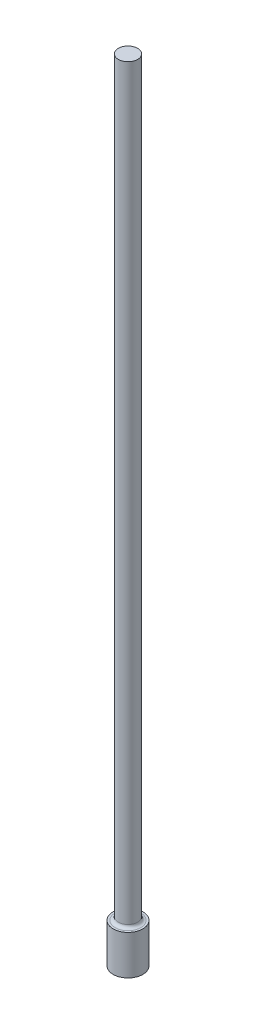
ISO-10303-21;
HEADER;
FILE_DESCRIPTION(('STEP AP214'),'2;1');
FILE_NAME('part.step','',(''),(''),'','','');
FILE_SCHEMA(('AUTOMOTIVE_DESIGN { 1 0 10303 214 1 1 1 1 }'));
ENDSEC;
DATA;
#1=APPLICATION_CONTEXT('core data for automotive mechanical design processes');
#2=APPLICATION_PROTOCOL_DEFINITION('international standard','automotive_design',2000,#1);
#3=PRODUCT_CONTEXT('',#1,'mechanical');
#4=PRODUCT('Part','Part','',(#3));
#5=PRODUCT_RELATED_PRODUCT_CATEGORY('part','',(#4));
#6=PRODUCT_DEFINITION_FORMATION('','',#4);
#7=PRODUCT_DEFINITION_CONTEXT('part definition',#1,'design');
#8=PRODUCT_DEFINITION('design','',#6,#7);
#9=PRODUCT_DEFINITION_SHAPE('','',#8);
#10=(LENGTH_UNIT() NAMED_UNIT(*) SI_UNIT(.MILLI.,.METRE.));
#11=(NAMED_UNIT(*) PLANE_ANGLE_UNIT() SI_UNIT($,.RADIAN.));
#12=(NAMED_UNIT(*) SI_UNIT($,.STERADIAN.) SOLID_ANGLE_UNIT());
#13=UNCERTAINTY_MEASURE_WITH_UNIT(LENGTH_MEASURE(1.E-05),#10,'distance_accuracy_value','');
#14=(GEOMETRIC_REPRESENTATION_CONTEXT(3) GLOBAL_UNCERTAINTY_ASSIGNED_CONTEXT((#13)) GLOBAL_UNIT_ASSIGNED_CONTEXT((#10,
#11,#12)) REPRESENTATION_CONTEXT('',''));
#15=CARTESIAN_POINT('',(0.,0.,0.));
#16=DIRECTION('',(0.,0.,1.));
#17=DIRECTION('',(1.,0.,0.));
#18=AXIS2_PLACEMENT_3D('',#15,#16,#17);
#19=CARTESIAN_POINT('',(0.,63.5,0.));
#20=DIRECTION('',(0.,-1.,0.));
#21=DIRECTION('',(0.,0.,-1.));
#22=AXIS2_PLACEMENT_3D('',#19,#20,#21);
#23=PLANE('',#22);
#24=CARTESIAN_POINT('',(0.,63.5,0.));
#25=DIRECTION('',(0.,1.,0.));
#26=DIRECTION('',(0.,0.,1.));
#27=AXIS2_PLACEMENT_3D('',#24,#25,#26);
#28=CIRCLE('',#27,0.7747);
#29=CARTESIAN_POINT('',(0.,63.5,0.7747));
#30=VERTEX_POINT('',#29);
#31=EDGE_CURVE('E10',#30,#30,#28,.T.);
#32=ORIENTED_EDGE('',*,*,#31,.T.);
#33=EDGE_LOOP('',(#32));
#34=FACE_BOUND('',#33,.T.);
#35=ADVANCED_FACE('F30',(#34),#23,.F.);
#36=CARTESIAN_POINT('',(0.,0.,0.));
#37=DIRECTION('',(0.,1.,0.));
#38=DIRECTION('',(0.,0.,1.));
#39=AXIS2_PLACEMENT_3D('',#36,#37,#38);
#40=CYLINDRICAL_SURFACE('',#39,0.7747);
#41=ORIENTED_EDGE('',*,*,#31,.F.);
#42=EDGE_LOOP('',(#41));
#43=FACE_BOUND('',#42,.T.);
#44=CARTESIAN_POINT('',(0.,3.429,0.));
#45=DIRECTION('',(0.,1.,0.));
#46=DIRECTION('',(0.,0.,1.));
#47=AXIS2_PLACEMENT_3D('',#44,#45,#46);
#48=CIRCLE('',#47,0.7747);
#49=CARTESIAN_POINT('',(0.,3.429,0.7747));
#50=VERTEX_POINT('',#49);
#51=EDGE_CURVE('E36',#50,#50,#48,.T.);
#52=ORIENTED_EDGE('',*,*,#51,.T.);
#53=EDGE_LOOP('',(#52));
#54=FACE_BOUND('',#53,.T.);
#55=ADVANCED_FACE('F65',(#43,#54),#40,.T.);
#56=CARTESIAN_POINT('',(0.,3.429,0.));
#57=DIRECTION('',(0.,1.,0.));
#58=DIRECTION('',(0.,0.,1.));
#59=AXIS2_PLACEMENT_3D('',#56,#57,#58);
#60=TOROIDAL_SURFACE('',#59,1.0287,0.254);
#61=ORIENTED_EDGE('',*,*,#51,.F.);
#62=EDGE_LOOP('',(#61));
#63=FACE_BOUND('',#62,.T.);
#64=CARTESIAN_POINT('',(0.,3.175,0.));
#65=DIRECTION('',(0.,1.,0.));
#66=DIRECTION('',(0.,0.,1.));
#67=AXIS2_PLACEMENT_3D('',#64,#65,#66);
#68=CIRCLE('',#67,1.0287);
#69=CARTESIAN_POINT('',(0.,3.175,1.0287));
#70=VERTEX_POINT('',#69);
#71=EDGE_CURVE('E40',#70,#70,#68,.T.);
#72=ORIENTED_EDGE('',*,*,#71,.T.);
#73=EDGE_LOOP('',(#72));
#74=FACE_BOUND('',#73,.T.);
#75=ADVANCED_FACE('F69',(#63,#74),#60,.F.);
#76=CARTESIAN_POINT('',(1.1938,3.175,0.));
#77=DIRECTION('',(0.,-1.,0.));
#78=DIRECTION('',(0.,0.,-1.));
#79=AXIS2_PLACEMENT_3D('',#76,#77,#78);
#80=PLANE('',#79);
#81=ORIENTED_EDGE('',*,*,#71,.F.);
#82=EDGE_LOOP('',(#81));
#83=FACE_BOUND('',#82,.T.);
#84=CARTESIAN_POINT('',(0.,3.175,0.));
#85=DIRECTION('',(0.,1.,0.));
#86=DIRECTION('',(0.,0.,1.));
#87=AXIS2_PLACEMENT_3D('',#84,#85,#86);
#88=CIRCLE('',#87,1.1938);
#89=CARTESIAN_POINT('',(0.,3.175,1.1938));
#90=VERTEX_POINT('',#89);
#91=EDGE_CURVE('E44',#90,#90,#88,.T.);
#92=ORIENTED_EDGE('',*,*,#91,.T.);
#93=EDGE_LOOP('',(#92));
#94=FACE_BOUND('',#93,.T.);
#95=ADVANCED_FACE('F61',(#83,#94),#80,.F.);
#96=CARTESIAN_POINT('',(0.,0.,0.));
#97=DIRECTION('',(0.,1.,0.));
#98=DIRECTION('',(0.,0.,1.));
#99=AXIS2_PLACEMENT_3D('',#96,#97,#98);
#100=CYLINDRICAL_SURFACE('',#99,1.1938);
#101=ORIENTED_EDGE('',*,*,#91,.F.);
#102=EDGE_LOOP('',(#101));
#103=FACE_BOUND('',#102,.T.);
#104=CARTESIAN_POINT('',(0.,0.,0.));
#105=DIRECTION('',(0.,1.,0.));
#106=DIRECTION('',(0.,0.,1.));
#107=AXIS2_PLACEMENT_3D('',#104,#105,#106);
#108=CIRCLE('',#107,1.1938);
#109=CARTESIAN_POINT('',(0.,0.,1.1938));
#110=VERTEX_POINT('',#109);
#111=EDGE_CURVE('E49',#110,#110,#108,.T.);
#112=ORIENTED_EDGE('',*,*,#111,.T.);
#113=EDGE_LOOP('',(#112));
#114=FACE_BOUND('',#113,.T.);
#115=ADVANCED_FACE('F53',(#103,#114),#100,.T.);
#116=CARTESIAN_POINT('',(0.,0.,0.));
#117=DIRECTION('',(0.,1.,0.));
#118=DIRECTION('',(0.,0.,1.));
#119=AXIS2_PLACEMENT_3D('',#116,#117,#118);
#120=PLANE('',#119);
#121=ORIENTED_EDGE('',*,*,#111,.F.);
#122=EDGE_LOOP('',(#121));
#123=FACE_BOUND('',#122,.T.);
#124=ADVANCED_FACE('F55',(#123),#120,.F.);
#125=CLOSED_SHELL('',(#35,#55,#75,#95,#115,#124));
#126=MANIFOLD_SOLID_BREP('B2',#125);
#127=ADVANCED_BREP_SHAPE_REPRESENTATION('',(#18,#126),#14);
#128=SHAPE_DEFINITION_REPRESENTATION(#9,#127);
ENDSEC;
END-ISO-10303-21;
